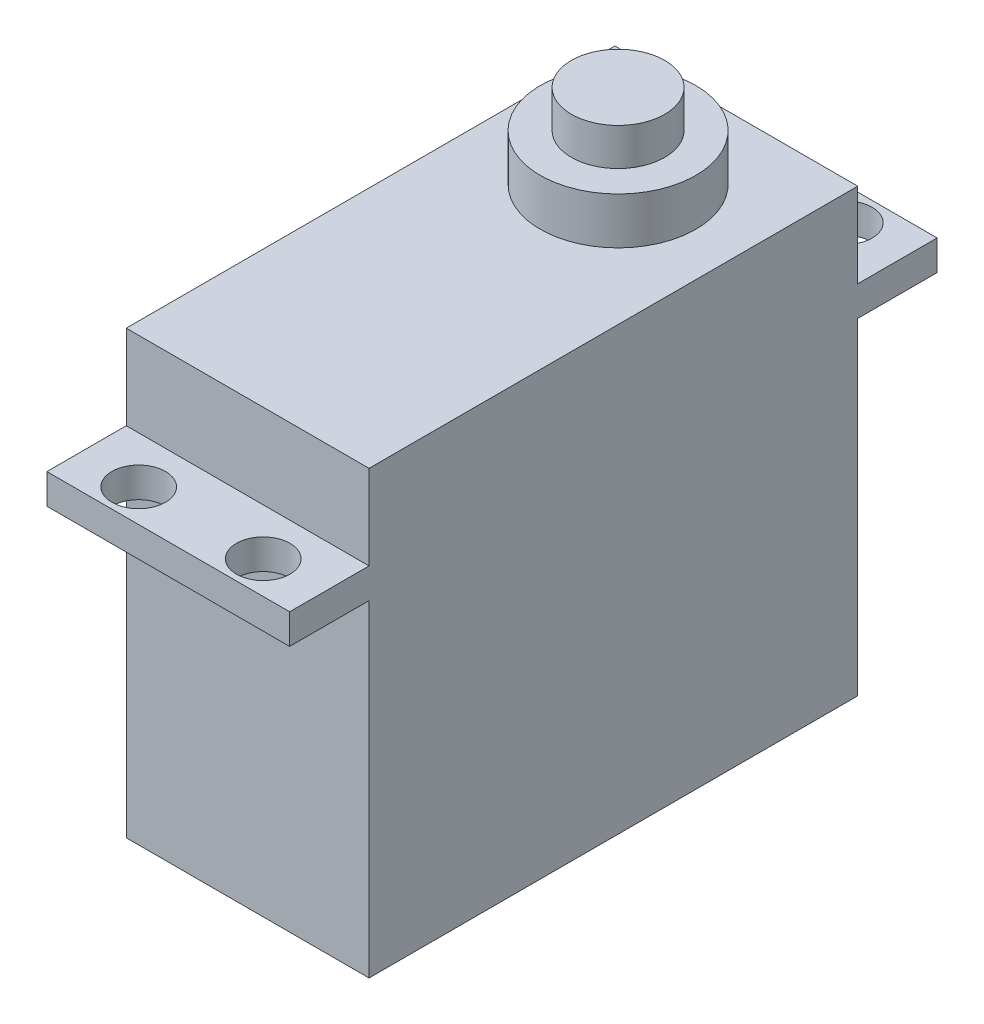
ISO-10303-21;
HEADER;
FILE_DESCRIPTION(('STEP AP214'),'2;1');
FILE_NAME('part.step','',(''),(''),'','','');
FILE_SCHEMA(('AUTOMOTIVE_DESIGN { 1 0 10303 214 1 1 1 1 }'));
ENDSEC;
DATA;
#1=APPLICATION_CONTEXT('core data for automotive mechanical design processes');
#2=APPLICATION_PROTOCOL_DEFINITION('international standard','automotive_design',2000,#1);
#3=PRODUCT_CONTEXT('',#1,'mechanical');
#4=PRODUCT('Part','Part','',(#3));
#5=PRODUCT_RELATED_PRODUCT_CATEGORY('part','',(#4));
#6=PRODUCT_DEFINITION_FORMATION('','',#4);
#7=PRODUCT_DEFINITION_CONTEXT('part definition',#1,'design');
#8=PRODUCT_DEFINITION('design','',#6,#7);
#9=PRODUCT_DEFINITION_SHAPE('','',#8);
#10=(LENGTH_UNIT() NAMED_UNIT(*) SI_UNIT(.MILLI.,.METRE.));
#11=(NAMED_UNIT(*) PLANE_ANGLE_UNIT() SI_UNIT($,.RADIAN.));
#12=(NAMED_UNIT(*) SI_UNIT($,.STERADIAN.) SOLID_ANGLE_UNIT());
#13=UNCERTAINTY_MEASURE_WITH_UNIT(LENGTH_MEASURE(1.E-05),#10,'distance_accuracy_value','');
#14=(GEOMETRIC_REPRESENTATION_CONTEXT(3) GLOBAL_UNCERTAINTY_ASSIGNED_CONTEXT((#13)) GLOBAL_UNIT_ASSIGNED_CONTEXT((#10,
#11,#12)) REPRESENTATION_CONTEXT('',''));
#15=CARTESIAN_POINT('',(0.,0.,0.));
#16=DIRECTION('',(0.,0.,1.));
#17=DIRECTION('',(1.,0.,0.));
#18=AXIS2_PLACEMENT_3D('',#15,#16,#17);
#19=CARTESIAN_POINT('',(0.,39.8272,-10.287));
#20=DIRECTION('',(0.,1.,0.));
#21=DIRECTION('',(0.,0.,1.));
#22=AXIS2_PLACEMENT_3D('',#19,#20,#21);
#23=PLANE('',#22);
#24=CARTESIAN_POINT('',(0.,39.8272,-10.287));
#25=DIRECTION('',(0.,1.,0.));
#26=DIRECTION('',(0.,0.,1.));
#27=AXIS2_PLACEMENT_3D('',#24,#25,#26);
#28=CIRCLE('',#27,6.35);
#29=CARTESIAN_POINT('',(0.,39.8272,-16.637));
#30=VERTEX_POINT('',#29);
#31=EDGE_CURVE('E248',#30,#30,#28,.T.);
#32=ORIENTED_EDGE('',*,*,#31,.T.);
#33=EDGE_LOOP('',(#32));
#34=FACE_BOUND('',#33,.T.);
#35=CARTESIAN_POINT('',(0.,39.8272,-10.287));
#36=DIRECTION('',(0.,1.,0.));
#37=DIRECTION('',(0.,0.,1.));
#38=AXIS2_PLACEMENT_3D('',#35,#36,#37);
#39=CIRCLE('',#38,3.81);
#40=CARTESIAN_POINT('',(0.,39.8272,-14.097));
#41=VERTEX_POINT('',#40);
#42=EDGE_CURVE('E256',#41,#41,#39,.T.);
#43=ORIENTED_EDGE('',*,*,#42,.F.);
#44=EDGE_LOOP('',(#43));
#45=FACE_BOUND('',#44,.T.);
#46=ADVANCED_FACE('F31',(#34,#45),#23,.T.);
#47=CARTESIAN_POINT('',(-9.906,36.0172,19.939));
#48=DIRECTION('',(0.,1.,0.));
#49=DIRECTION('',(0.,0.,1.));
#50=AXIS2_PLACEMENT_3D('',#47,#48,#49);
#51=PLANE('',#50);
#52=DIRECTION('',(0.,0.,1.));
#53=VECTOR('',#52,1.);
#54=CARTESIAN_POINT('',(-9.906,36.0172,-19.939));
#55=LINE('',#54,#53);
#56=CARTESIAN_POINT('',(-9.906,36.0172,-19.939));
#57=VERTEX_POINT('',#56);
#58=CARTESIAN_POINT('',(-9.906,36.0172,19.939));
#59=VERTEX_POINT('',#58);
#60=EDGE_CURVE('E457',#57,#59,#55,.T.);
#61=ORIENTED_EDGE('',*,*,#60,.T.);
#62=DIRECTION('',(1.,0.,0.));
#63=VECTOR('',#62,1.);
#64=CARTESIAN_POINT('',(-9.906,36.0172,19.939));
#65=LINE('',#64,#63);
#66=CARTESIAN_POINT('',(9.906,36.0172,19.939));
#67=VERTEX_POINT('',#66);
#68=EDGE_CURVE('E490',#59,#67,#65,.T.);
#69=ORIENTED_EDGE('',*,*,#68,.T.);
#70=DIRECTION('',(0.,0.,-1.));
#71=VECTOR('',#70,1.);
#72=CARTESIAN_POINT('',(9.906,36.0172,-19.939));
#73=LINE('',#72,#71);
#74=CARTESIAN_POINT('',(9.906,36.0172,-19.939));
#75=VERTEX_POINT('',#74);
#76=EDGE_CURVE('E491',#67,#75,#73,.T.);
#77=ORIENTED_EDGE('',*,*,#76,.T.);
#78=DIRECTION('',(-1.,0.,0.));
#79=VECTOR('',#78,1.);
#80=CARTESIAN_POINT('',(-9.906,36.0172,-19.939));
#81=LINE('',#80,#79);
#82=EDGE_CURVE('E451',#75,#57,#81,.T.);
#83=ORIENTED_EDGE('',*,*,#82,.T.);
#84=EDGE_LOOP('',(#61,#69,#77,#83));
#85=FACE_BOUND('',#84,.T.);
#86=CARTESIAN_POINT('',(0.,36.0172,-10.287));
#87=DIRECTION('',(0.,1.,0.));
#88=DIRECTION('',(0.,0.,1.));
#89=AXIS2_PLACEMENT_3D('',#86,#87,#88);
#90=CIRCLE('',#89,6.35);
#91=CARTESIAN_POINT('',(0.,36.0172,-16.637));
#92=VERTEX_POINT('',#91);
#93=EDGE_CURVE('E251',#92,#92,#90,.T.);
#94=ORIENTED_EDGE('',*,*,#93,.F.);
#95=EDGE_LOOP('',(#94));
#96=FACE_BOUND('',#95,.T.);
#97=ADVANCED_FACE('F211',(#85,#96),#51,.T.);
#98=CARTESIAN_POINT('',(-9.906,26.67,26.416));
#99=DIRECTION('',(0.,1.,0.));
#100=DIRECTION('',(0.,0.,1.));
#101=AXIS2_PLACEMENT_3D('',#98,#99,#100);
#102=PLANE('',#101);
#103=DIRECTION('',(1.,0.,0.));
#104=VECTOR('',#103,1.);
#105=CARTESIAN_POINT('',(-9.906,26.67,19.939));
#106=LINE('',#105,#104);
#107=CARTESIAN_POINT('',(-9.906,26.67,19.939));
#108=VERTEX_POINT('',#107);
#109=CARTESIAN_POINT('',(9.906,26.67,19.939));
#110=VERTEX_POINT('',#109);
#111=EDGE_CURVE('E56',#108,#110,#106,.T.);
#112=ORIENTED_EDGE('',*,*,#111,.T.);
#113=DIRECTION('',(0.,0.,-1.));
#114=VECTOR('',#113,1.);
#115=CARTESIAN_POINT('',(9.906,26.67,26.416));
#116=LINE('',#115,#114);
#117=CARTESIAN_POINT('',(9.906,26.67,26.416));
#118=VERTEX_POINT('',#117);
#119=EDGE_CURVE('E448',#118,#110,#116,.T.);
#120=ORIENTED_EDGE('',*,*,#119,.F.);
#121=DIRECTION('',(1.,0.,0.));
#122=VECTOR('',#121,1.);
#123=CARTESIAN_POINT('',(-9.906,26.67,26.416));
#124=LINE('',#123,#122);
#125=CARTESIAN_POINT('',(-9.906,26.67,26.416));
#126=VERTEX_POINT('',#125);
#127=EDGE_CURVE('E518',#126,#118,#124,.T.);
#128=ORIENTED_EDGE('',*,*,#127,.F.);
#129=DIRECTION('',(0.,0.,-1.));
#130=VECTOR('',#129,1.);
#131=CARTESIAN_POINT('',(-9.906,26.67,26.416));
#132=LINE('',#131,#130);
#133=EDGE_CURVE('E443',#126,#108,#132,.T.);
#134=ORIENTED_EDGE('',*,*,#133,.T.);
#135=EDGE_LOOP('',(#112,#120,#128,#134));
#136=FACE_BOUND('',#135,.T.);
#137=CARTESIAN_POINT('',(5.08,26.67,23.749));
#138=DIRECTION('',(0.,1.,0.));
#139=DIRECTION('',(0.,0.,1.));
#140=AXIS2_PLACEMENT_3D('',#137,#138,#139);
#141=CIRCLE('',#140,2.1844);
#142=CARTESIAN_POINT('',(5.08,26.67,25.9334));
#143=VERTEX_POINT('',#142);
#144=EDGE_CURVE('E157',#143,#143,#141,.T.);
#145=ORIENTED_EDGE('',*,*,#144,.T.);
#146=EDGE_LOOP('',(#145));
#147=FACE_BOUND('',#146,.T.);
#148=CARTESIAN_POINT('',(-5.08,26.67,23.749));
#149=DIRECTION('',(0.,1.,0.));
#150=DIRECTION('',(0.,0.,1.));
#151=AXIS2_PLACEMENT_3D('',#148,#149,#150);
#152=CIRCLE('',#151,2.1844);
#153=CARTESIAN_POINT('',(-5.08,26.67,25.9334));
#154=VERTEX_POINT('',#153);
#155=EDGE_CURVE('E242',#154,#154,#152,.F.);
#156=ORIENTED_EDGE('',*,*,#155,.F.);
#157=EDGE_LOOP('',(#156));
#158=FACE_BOUND('',#157,.T.);
#159=ADVANCED_FACE('F193',(#136,#147,#158),#102,.F.);
#160=CARTESIAN_POINT('',(-9.906,29.12,26.416));
#161=DIRECTION('',(0.,-1.,0.));
#162=DIRECTION('',(0.,0.,-1.));
#163=AXIS2_PLACEMENT_3D('',#160,#161,#162);
#164=PLANE('',#163);
#165=DIRECTION('',(-1.,0.,0.));
#166=VECTOR('',#165,1.);
#167=CARTESIAN_POINT('',(-9.906,29.12,19.939));
#168=LINE('',#167,#166);
#169=CARTESIAN_POINT('',(9.906,29.12,19.939));
#170=VERTEX_POINT('',#169);
#171=CARTESIAN_POINT('',(-9.906,29.12,19.939));
#172=VERTEX_POINT('',#171);
#173=EDGE_CURVE('E477',#170,#172,#168,.T.);
#174=ORIENTED_EDGE('',*,*,#173,.T.);
#175=DIRECTION('',(0.,0.,-1.));
#176=VECTOR('',#175,1.);
#177=CARTESIAN_POINT('',(-9.906,29.12,26.416));
#178=LINE('',#177,#176);
#179=CARTESIAN_POINT('',(-9.906,29.12,26.416));
#180=VERTEX_POINT('',#179);
#181=EDGE_CURVE('E471',#180,#172,#178,.T.);
#182=ORIENTED_EDGE('',*,*,#181,.F.);
#183=DIRECTION('',(-1.,0.,0.));
#184=VECTOR('',#183,1.);
#185=CARTESIAN_POINT('',(-9.906,29.12,26.416));
#186=LINE('',#185,#184);
#187=CARTESIAN_POINT('',(9.906,29.12,26.416));
#188=VERTEX_POINT('',#187);
#189=EDGE_CURVE('E476',#188,#180,#186,.T.);
#190=ORIENTED_EDGE('',*,*,#189,.F.);
#191=DIRECTION('',(0.,0.,-1.));
#192=VECTOR('',#191,1.);
#193=CARTESIAN_POINT('',(9.906,29.12,26.416));
#194=LINE('',#193,#192);
#195=EDGE_CURVE('E468',#188,#170,#194,.T.);
#196=ORIENTED_EDGE('',*,*,#195,.T.);
#197=EDGE_LOOP('',(#174,#182,#190,#196));
#198=FACE_BOUND('',#197,.T.);
#199=CARTESIAN_POINT('',(5.08,29.12,23.749));
#200=DIRECTION('',(0.,1.,0.));
#201=DIRECTION('',(0.,0.,1.));
#202=AXIS2_PLACEMENT_3D('',#199,#200,#201);
#203=CIRCLE('',#202,2.1844);
#204=CARTESIAN_POINT('',(5.08,29.12,25.9334));
#205=VERTEX_POINT('',#204);
#206=EDGE_CURVE('E177',#205,#205,#203,.T.);
#207=ORIENTED_EDGE('',*,*,#206,.F.);
#208=EDGE_LOOP('',(#207));
#209=FACE_BOUND('',#208,.T.);
#210=CARTESIAN_POINT('',(-5.08,29.12,23.749));
#211=DIRECTION('',(0.,-1.,0.));
#212=DIRECTION('',(0.,0.,1.));
#213=AXIS2_PLACEMENT_3D('',#210,#211,#212);
#214=CIRCLE('',#213,2.1844);
#215=CARTESIAN_POINT('',(-5.08,29.12,25.9334));
#216=VERTEX_POINT('',#215);
#217=EDGE_CURVE('E244',#216,#216,#214,.T.);
#218=ORIENTED_EDGE('',*,*,#217,.T.);
#219=EDGE_LOOP('',(#218));
#220=FACE_BOUND('',#219,.T.);
#221=ADVANCED_FACE('F326',(#198,#209,#220),#164,.F.);
#222=CARTESIAN_POINT('',(-9.906,29.12,-26.416));
#223=DIRECTION('',(0.,1.,0.));
#224=DIRECTION('',(0.,0.,1.));
#225=AXIS2_PLACEMENT_3D('',#222,#223,#224);
#226=PLANE('',#225);
#227=CARTESIAN_POINT('',(-5.08,29.12,-23.749));
#228=DIRECTION('',(0.,1.,0.));
#229=DIRECTION('',(0.,0.,-1.));
#230=AXIS2_PLACEMENT_3D('',#227,#228,#229);
#231=CIRCLE('',#230,2.1844);
#232=CARTESIAN_POINT('',(-5.08,29.12,-25.9334));
#233=VERTEX_POINT('',#232);
#234=EDGE_CURVE('E187',#233,#233,#231,.T.);
#235=ORIENTED_EDGE('',*,*,#234,.F.);
#236=EDGE_LOOP('',(#235));
#237=FACE_BOUND('',#236,.T.);
#238=DIRECTION('',(-1.,0.,0.));
#239=VECTOR('',#238,1.);
#240=CARTESIAN_POINT('',(-9.906,29.12,-19.939));
#241=LINE('',#240,#239);
#242=CARTESIAN_POINT('',(9.906,29.12,-19.939));
#243=VERTEX_POINT('',#242);
#244=CARTESIAN_POINT('',(-9.906,29.12,-19.939));
#245=VERTEX_POINT('',#244);
#246=EDGE_CURVE('E155',#243,#245,#241,.T.);
#247=ORIENTED_EDGE('',*,*,#246,.F.);
#248=DIRECTION('',(0.,0.,1.));
#249=VECTOR('',#248,1.);
#250=CARTESIAN_POINT('',(9.906,29.12,-26.416));
#251=LINE('',#250,#249);
#252=CARTESIAN_POINT('',(9.906,29.12,-26.416));
#253=VERTEX_POINT('',#252);
#254=EDGE_CURVE('E129',#253,#243,#251,.T.);
#255=ORIENTED_EDGE('',*,*,#254,.F.);
#256=DIRECTION('',(-1.,0.,0.));
#257=VECTOR('',#256,1.);
#258=CARTESIAN_POINT('',(-9.906,29.12,-26.416));
#259=LINE('',#258,#257);
#260=CARTESIAN_POINT('',(-9.906,29.12,-26.416));
#261=VERTEX_POINT('',#260);
#262=EDGE_CURVE('E135',#253,#261,#259,.T.);
#263=ORIENTED_EDGE('',*,*,#262,.T.);
#264=DIRECTION('',(0.,0.,1.));
#265=VECTOR('',#264,1.);
#266=CARTESIAN_POINT('',(-9.906,29.12,-26.416));
#267=LINE('',#266,#265);
#268=EDGE_CURVE('E48',#261,#245,#267,.T.);
#269=ORIENTED_EDGE('',*,*,#268,.T.);
#270=EDGE_LOOP('',(#247,#255,#263,#269));
#271=FACE_BOUND('',#270,.T.);
#272=CARTESIAN_POINT('',(5.08,29.12,-23.749));
#273=DIRECTION('',(0.,-1.,0.));
#274=DIRECTION('',(0.,0.,-1.));
#275=AXIS2_PLACEMENT_3D('',#272,#273,#274);
#276=CIRCLE('',#275,2.1844);
#277=CARTESIAN_POINT('',(5.08,29.12,-25.9334));
#278=VERTEX_POINT('',#277);
#279=EDGE_CURVE('E178',#278,#278,#276,.T.);
#280=ORIENTED_EDGE('',*,*,#279,.T.);
#281=EDGE_LOOP('',(#280));
#282=FACE_BOUND('',#281,.T.);
#283=ADVANCED_FACE('F141',(#237,#271,#282),#226,.T.);
#284=CARTESIAN_POINT('',(-9.906,26.67,-26.416));
#285=DIRECTION('',(0.,-1.,0.));
#286=DIRECTION('',(0.,0.,-1.));
#287=AXIS2_PLACEMENT_3D('',#284,#285,#286);
#288=PLANE('',#287);
#289=CARTESIAN_POINT('',(-5.08,26.67,-23.749));
#290=DIRECTION('',(0.,-1.,0.));
#291=DIRECTION('',(0.,0.,-1.));
#292=AXIS2_PLACEMENT_3D('',#289,#290,#291);
#293=CIRCLE('',#292,2.1844);
#294=CARTESIAN_POINT('',(-5.08,26.67,-25.9334));
#295=VERTEX_POINT('',#294);
#296=EDGE_CURVE('E35',#295,#295,#293,.T.);
#297=ORIENTED_EDGE('',*,*,#296,.F.);
#298=EDGE_LOOP('',(#297));
#299=FACE_BOUND('',#298,.T.);
#300=DIRECTION('',(1.,0.,0.));
#301=VECTOR('',#300,1.);
#302=CARTESIAN_POINT('',(-9.906,26.67,-19.939));
#303=LINE('',#302,#301);
#304=CARTESIAN_POINT('',(-9.906,26.67,-19.939));
#305=VERTEX_POINT('',#304);
#306=CARTESIAN_POINT('',(9.906,26.67,-19.939));
#307=VERTEX_POINT('',#306);
#308=EDGE_CURVE('E139',#305,#307,#303,.T.);
#309=ORIENTED_EDGE('',*,*,#308,.F.);
#310=DIRECTION('',(0.,0.,1.));
#311=VECTOR('',#310,1.);
#312=CARTESIAN_POINT('',(-9.906,26.67,-26.416));
#313=LINE('',#312,#311);
#314=CARTESIAN_POINT('',(-9.906,26.67,-26.416));
#315=VERTEX_POINT('',#314);
#316=EDGE_CURVE('E149',#315,#305,#313,.T.);
#317=ORIENTED_EDGE('',*,*,#316,.F.);
#318=DIRECTION('',(1.,0.,0.));
#319=VECTOR('',#318,1.);
#320=CARTESIAN_POINT('',(-9.906,26.67,-26.416));
#321=LINE('',#320,#319);
#322=CARTESIAN_POINT('',(9.906,26.67,-26.416));
#323=VERTEX_POINT('',#322);
#324=EDGE_CURVE('E138',#315,#323,#321,.T.);
#325=ORIENTED_EDGE('',*,*,#324,.T.);
#326=DIRECTION('',(0.,0.,1.));
#327=VECTOR('',#326,1.);
#328=CARTESIAN_POINT('',(9.906,26.67,-26.416));
#329=LINE('',#328,#327);
#330=EDGE_CURVE('E165',#323,#307,#329,.T.);
#331=ORIENTED_EDGE('',*,*,#330,.T.);
#332=EDGE_LOOP('',(#309,#317,#325,#331));
#333=FACE_BOUND('',#332,.T.);
#334=CARTESIAN_POINT('',(5.08,26.67,-23.749));
#335=DIRECTION('',(0.,-1.,0.));
#336=DIRECTION('',(0.,0.,-1.));
#337=AXIS2_PLACEMENT_3D('',#334,#335,#336);
#338=CIRCLE('',#337,2.1844);
#339=CARTESIAN_POINT('',(5.08,26.67,-25.9334));
#340=VERTEX_POINT('',#339);
#341=EDGE_CURVE('E175',#340,#340,#338,.F.);
#342=ORIENTED_EDGE('',*,*,#341,.T.);
#343=EDGE_LOOP('',(#342));
#344=FACE_BOUND('',#343,.T.);
#345=ADVANCED_FACE('F309',(#299,#333,#344),#288,.T.);
#346=CARTESIAN_POINT('',(-9.906,36.0172,-19.939));
#347=DIRECTION('',(0.,0.,1.));
#348=DIRECTION('',(1.,0.,0.));
#349=AXIS2_PLACEMENT_3D('',#346,#347,#348);
#350=PLANE('',#349);
#351=DIRECTION('',(0.,-1.,0.));
#352=VECTOR('',#351,1.);
#353=CARTESIAN_POINT('',(-9.906,36.0172,-19.939));
#354=LINE('',#353,#352);
#355=CARTESIAN_POINT('',(-9.906,0.,-19.939));
#356=VERTEX_POINT('',#355);
#357=EDGE_CURVE('E463',#305,#356,#354,.T.);
#358=ORIENTED_EDGE('',*,*,#357,.F.);
#359=ORIENTED_EDGE('',*,*,#308,.T.);
#360=DIRECTION('',(0.,-1.,0.));
#361=VECTOR('',#360,1.);
#362=CARTESIAN_POINT('',(9.906,36.0172,-19.939));
#363=LINE('',#362,#361);
#364=CARTESIAN_POINT('',(9.906,0.,-19.939));
#365=VERTEX_POINT('',#364);
#366=EDGE_CURVE('E158',#307,#365,#363,.T.);
#367=ORIENTED_EDGE('',*,*,#366,.T.);
#368=DIRECTION('',(-1.,0.,0.));
#369=VECTOR('',#368,1.);
#370=CARTESIAN_POINT('',(-9.906,0.,-19.939));
#371=LINE('',#370,#369);
#372=EDGE_CURVE('E440',#365,#356,#371,.T.);
#373=ORIENTED_EDGE('',*,*,#372,.T.);
#374=EDGE_LOOP('',(#358,#359,#367,#373));
#375=FACE_BOUND('',#374,.T.);
#376=ADVANCED_FACE('F314',(#375),#350,.F.);
#377=CARTESIAN_POINT('',(-9.906,36.0172,19.939));
#378=DIRECTION('',(0.,0.,-1.));
#379=DIRECTION('',(-1.,0.,0.));
#380=AXIS2_PLACEMENT_3D('',#377,#378,#379);
#381=PLANE('',#380);
#382=ORIENTED_EDGE('',*,*,#173,.F.);
#383=DIRECTION('',(0.,-1.,0.));
#384=VECTOR('',#383,1.);
#385=CARTESIAN_POINT('',(9.906,36.0172,19.939));
#386=LINE('',#385,#384);
#387=EDGE_CURVE('E503',#67,#170,#386,.T.);
#388=ORIENTED_EDGE('',*,*,#387,.F.);
#389=ORIENTED_EDGE('',*,*,#68,.F.);
#390=DIRECTION('',(0.,-1.,0.));
#391=VECTOR('',#390,1.);
#392=CARTESIAN_POINT('',(-9.906,36.0172,19.939));
#393=LINE('',#392,#391);
#394=EDGE_CURVE('E11',#59,#172,#393,.T.);
#395=ORIENTED_EDGE('',*,*,#394,.T.);
#396=EDGE_LOOP('',(#382,#388,#389,#395));
#397=FACE_BOUND('',#396,.T.);
#398=ADVANCED_FACE('F401',(#397),#381,.F.);
#399=ORIENTED_EDGE('',*,*,#111,.F.);
#400=CARTESIAN_POINT('',(-9.906,0.,19.939));
#401=VERTEX_POINT('',#400);
#402=EDGE_CURVE('E40',#108,#401,#393,.T.);
#403=ORIENTED_EDGE('',*,*,#402,.T.);
#404=DIRECTION('',(1.,0.,0.));
#405=VECTOR('',#404,1.);
#406=CARTESIAN_POINT('',(-9.906,0.,19.939));
#407=LINE('',#406,#405);
#408=CARTESIAN_POINT('',(9.906,0.,19.939));
#409=VERTEX_POINT('',#408);
#410=EDGE_CURVE('E442',#401,#409,#407,.T.);
#411=ORIENTED_EDGE('',*,*,#410,.T.);
#412=EDGE_CURVE('E500',#110,#409,#386,.T.);
#413=ORIENTED_EDGE('',*,*,#412,.F.);
#414=EDGE_LOOP('',(#399,#403,#411,#413));
#415=FACE_BOUND('',#414,.T.);
#416=ADVANCED_FACE('F392',(#415),#381,.F.);
#417=CARTESIAN_POINT('',(-9.906,36.0172,-19.939));
#418=DIRECTION('',(1.,0.,0.));
#419=DIRECTION('',(0.,0.,-1.));
#420=AXIS2_PLACEMENT_3D('',#417,#418,#419);
#421=PLANE('',#420);
#422=DIRECTION('',(0.,0.,1.));
#423=VECTOR('',#422,1.);
#424=CARTESIAN_POINT('',(-9.906,0.,-19.939));
#425=LINE('',#424,#423);
#426=EDGE_CURVE('E437',#356,#401,#425,.T.);
#427=ORIENTED_EDGE('',*,*,#426,.T.);
#428=ORIENTED_EDGE('',*,*,#402,.F.);
#429=ORIENTED_EDGE('',*,*,#133,.F.);
#430=DIRECTION('',(0.,-1.,0.));
#431=VECTOR('',#430,1.);
#432=CARTESIAN_POINT('',(-9.906,29.12,26.416));
#433=LINE('',#432,#431);
#434=EDGE_CURVE('E481',#180,#126,#433,.T.);
#435=ORIENTED_EDGE('',*,*,#434,.F.);
#436=ORIENTED_EDGE('',*,*,#181,.T.);
#437=ORIENTED_EDGE('',*,*,#394,.F.);
#438=ORIENTED_EDGE('',*,*,#60,.F.);
#439=EDGE_CURVE('E128',#57,#245,#354,.T.);
#440=ORIENTED_EDGE('',*,*,#439,.T.);
#441=ORIENTED_EDGE('',*,*,#268,.F.);
#442=DIRECTION('',(0.,-1.,0.));
#443=VECTOR('',#442,1.);
#444=CARTESIAN_POINT('',(-9.906,29.12,-26.416));
#445=LINE('',#444,#443);
#446=EDGE_CURVE('E124',#261,#315,#445,.T.);
#447=ORIENTED_EDGE('',*,*,#446,.T.);
#448=ORIENTED_EDGE('',*,*,#316,.T.);
#449=ORIENTED_EDGE('',*,*,#357,.T.);
#450=EDGE_LOOP('',(#427,#428,#429,#435,#436,#437,#438,#440,#441,#447,#448,#449));
#451=FACE_BOUND('',#450,.T.);
#452=ADVANCED_FACE('F33',(#451),#421,.F.);
#453=CARTESIAN_POINT('',(9.906,36.0172,-19.939));
#454=DIRECTION('',(-1.,0.,0.));
#455=DIRECTION('',(0.,0.,1.));
#456=AXIS2_PLACEMENT_3D('',#453,#454,#455);
#457=PLANE('',#456);
#458=DIRECTION('',(0.,0.,-1.));
#459=VECTOR('',#458,1.);
#460=CARTESIAN_POINT('',(9.906,0.,-19.939));
#461=LINE('',#460,#459);
#462=EDGE_CURVE('E445',#409,#365,#461,.T.);
#463=ORIENTED_EDGE('',*,*,#462,.T.);
#464=ORIENTED_EDGE('',*,*,#366,.F.);
#465=ORIENTED_EDGE('',*,*,#330,.F.);
#466=DIRECTION('',(0.,1.,0.));
#467=VECTOR('',#466,1.);
#468=CARTESIAN_POINT('',(9.906,29.12,-26.416));
#469=LINE('',#468,#467);
#470=EDGE_CURVE('E143',#323,#253,#469,.T.);
#471=ORIENTED_EDGE('',*,*,#470,.T.);
#472=ORIENTED_EDGE('',*,*,#254,.T.);
#473=EDGE_CURVE('E498',#75,#243,#363,.T.);
#474=ORIENTED_EDGE('',*,*,#473,.F.);
#475=ORIENTED_EDGE('',*,*,#76,.F.);
#476=ORIENTED_EDGE('',*,*,#387,.T.);
#477=ORIENTED_EDGE('',*,*,#195,.F.);
#478=DIRECTION('',(0.,1.,0.));
#479=VECTOR('',#478,1.);
#480=CARTESIAN_POINT('',(9.906,29.12,26.416));
#481=LINE('',#480,#479);
#482=EDGE_CURVE('E523',#118,#188,#481,.T.);
#483=ORIENTED_EDGE('',*,*,#482,.F.);
#484=ORIENTED_EDGE('',*,*,#119,.T.);
#485=ORIENTED_EDGE('',*,*,#412,.T.);
#486=EDGE_LOOP('',(#463,#464,#465,#471,#472,#474,#475,#476,#477,#483,#484,#485));
#487=FACE_BOUND('',#486,.T.);
#488=ADVANCED_FACE('F370',(#487),#457,.F.);
#489=ORIENTED_EDGE('',*,*,#473,.T.);
#490=ORIENTED_EDGE('',*,*,#246,.T.);
#491=ORIENTED_EDGE('',*,*,#439,.F.);
#492=ORIENTED_EDGE('',*,*,#82,.F.);
#493=EDGE_LOOP('',(#489,#490,#491,#492));
#494=FACE_BOUND('',#493,.T.);
#495=ADVANCED_FACE('F364',(#494),#350,.F.);
#496=CARTESIAN_POINT('',(-9.906,0.,19.939));
#497=DIRECTION('',(0.,1.,0.));
#498=DIRECTION('',(0.,0.,1.));
#499=AXIS2_PLACEMENT_3D('',#496,#497,#498);
#500=PLANE('',#499);
#501=ORIENTED_EDGE('',*,*,#426,.F.);
#502=ORIENTED_EDGE('',*,*,#372,.F.);
#503=ORIENTED_EDGE('',*,*,#462,.F.);
#504=ORIENTED_EDGE('',*,*,#410,.F.);
#505=EDGE_LOOP('',(#501,#502,#503,#504));
#506=FACE_BOUND('',#505,.T.);
#507=ADVANCED_FACE('F369',(#506),#500,.F.);
#508=CARTESIAN_POINT('',(-9.906,26.67,26.416));
#509=DIRECTION('',(0.,0.,1.));
#510=DIRECTION('',(1.,0.,0.));
#511=AXIS2_PLACEMENT_3D('',#508,#509,#510);
#512=PLANE('',#511);
#513=ORIENTED_EDGE('',*,*,#434,.T.);
#514=ORIENTED_EDGE('',*,*,#127,.T.);
#515=ORIENTED_EDGE('',*,*,#482,.T.);
#516=ORIENTED_EDGE('',*,*,#189,.T.);
#517=EDGE_LOOP('',(#513,#514,#515,#516));
#518=FACE_BOUND('',#517,.T.);
#519=ADVANCED_FACE('F208',(#518),#512,.T.);
#520=CARTESIAN_POINT('',(-9.906,26.67,-26.416));
#521=DIRECTION('',(0.,0.,-1.));
#522=DIRECTION('',(1.,0.,0.));
#523=AXIS2_PLACEMENT_3D('',#520,#521,#522);
#524=PLANE('',#523);
#525=ORIENTED_EDGE('',*,*,#446,.F.);
#526=ORIENTED_EDGE('',*,*,#262,.F.);
#527=ORIENTED_EDGE('',*,*,#470,.F.);
#528=ORIENTED_EDGE('',*,*,#324,.F.);
#529=EDGE_LOOP('',(#525,#526,#527,#528));
#530=FACE_BOUND('',#529,.T.);
#531=ADVANCED_FACE('F133',(#530),#524,.T.);
#532=CARTESIAN_POINT('',(5.08,-2.50000000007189E-05,23.749));
#533=DIRECTION('',(0.,1.,0.));
#534=DIRECTION('',(0.,0.,1.));
#535=AXIS2_PLACEMENT_3D('',#532,#533,#534);
#536=CYLINDRICAL_SURFACE('',#535,2.1844);
#537=ORIENTED_EDGE('',*,*,#206,.T.);
#538=EDGE_LOOP('',(#537));
#539=FACE_BOUND('',#538,.T.);
#540=ORIENTED_EDGE('',*,*,#144,.F.);
#541=EDGE_LOOP('',(#540));
#542=FACE_BOUND('',#541,.T.);
#543=ADVANCED_FACE('F196',(#539,#542),#536,.F.);
#544=CARTESIAN_POINT('',(5.08,-2.50000000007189E-05,-23.749));
#545=DIRECTION('',(0.,1.,0.));
#546=DIRECTION('',(0.,0.,1.));
#547=AXIS2_PLACEMENT_3D('',#544,#545,#546);
#548=CYLINDRICAL_SURFACE('',#547,2.1844);
#549=ORIENTED_EDGE('',*,*,#341,.F.);
#550=EDGE_LOOP('',(#549));
#551=FACE_BOUND('',#550,.T.);
#552=ORIENTED_EDGE('',*,*,#279,.F.);
#553=EDGE_LOOP('',(#552));
#554=FACE_BOUND('',#553,.T.);
#555=ADVANCED_FACE('F198',(#551,#554),#548,.F.);
#556=CARTESIAN_POINT('',(-5.08,-2.50000000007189E-05,-23.749));
#557=DIRECTION('',(0.,1.,0.));
#558=DIRECTION('',(0.,0.,1.));
#559=AXIS2_PLACEMENT_3D('',#556,#557,#558);
#560=CYLINDRICAL_SURFACE('',#559,2.1844);
#561=ORIENTED_EDGE('',*,*,#296,.T.);
#562=EDGE_LOOP('',(#561));
#563=FACE_BOUND('',#562,.T.);
#564=ORIENTED_EDGE('',*,*,#234,.T.);
#565=EDGE_LOOP('',(#564));
#566=FACE_BOUND('',#565,.T.);
#567=ADVANCED_FACE('F205',(#563,#566),#560,.F.);
#568=CARTESIAN_POINT('',(-5.08,-2.50000000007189E-05,23.749));
#569=DIRECTION('',(0.,1.,0.));
#570=DIRECTION('',(0.,0.,1.));
#571=AXIS2_PLACEMENT_3D('',#568,#569,#570);
#572=CYLINDRICAL_SURFACE('',#571,2.1844);
#573=ORIENTED_EDGE('',*,*,#217,.F.);
#574=EDGE_LOOP('',(#573));
#575=FACE_BOUND('',#574,.T.);
#576=ORIENTED_EDGE('',*,*,#155,.T.);
#577=EDGE_LOOP('',(#576));
#578=FACE_BOUND('',#577,.T.);
#579=ADVANCED_FACE('F228',(#575,#578),#572,.F.);
#580=CARTESIAN_POINT('',(0.,39.8272,-10.287));
#581=DIRECTION('',(0.,-1.,0.));
#582=DIRECTION('',(0.,0.,-1.));
#583=AXIS2_PLACEMENT_3D('',#580,#581,#582);
#584=CYLINDRICAL_SURFACE('',#583,6.35);
#585=CARTESIAN_POINT('',(0.,39.8272,-16.637));
#586=CARTESIAN_POINT('',(0.,39.7875125,-16.637));
#587=CARTESIAN_POINT('',(0.,39.747825,-16.637));
#588=CARTESIAN_POINT('',(0.,39.66845,-16.637));
#589=CARTESIAN_POINT('',(0.,39.6287625,-16.637));
#590=CARTESIAN_POINT('',(0.,39.5493875,-16.637));
#591=CARTESIAN_POINT('',(0.,39.5097,-16.637));
#592=CARTESIAN_POINT('',(0.,39.430325,-16.637));
#593=CARTESIAN_POINT('',(0.,39.3906375,-16.637));
#594=CARTESIAN_POINT('',(0.,39.3112625,-16.637));
#595=CARTESIAN_POINT('',(0.,39.271575,-16.637));
#596=CARTESIAN_POINT('',(0.,39.1922,-16.637));
#597=CARTESIAN_POINT('',(0.,39.1525125,-16.637));
#598=CARTESIAN_POINT('',(0.,39.0731375,-16.637));
#599=CARTESIAN_POINT('',(0.,39.03345,-16.637));
#600=CARTESIAN_POINT('',(0.,38.954075,-16.637));
#601=CARTESIAN_POINT('',(0.,38.9143875,-16.637));
#602=CARTESIAN_POINT('',(0.,38.8350125,-16.637));
#603=CARTESIAN_POINT('',(0.,38.795325,-16.637));
#604=CARTESIAN_POINT('',(0.,38.71595,-16.637));
#605=CARTESIAN_POINT('',(0.,38.6762625,-16.637));
#606=CARTESIAN_POINT('',(0.,38.5968875,-16.637));
#607=CARTESIAN_POINT('',(0.,38.5572,-16.637));
#608=CARTESIAN_POINT('',(0.,38.477825,-16.637));
#609=CARTESIAN_POINT('',(0.,38.4381375,-16.637));
#610=CARTESIAN_POINT('',(0.,38.3587625,-16.637));
#611=CARTESIAN_POINT('',(0.,38.319075,-16.637));
#612=CARTESIAN_POINT('',(0.,38.2397,-16.637));
#613=CARTESIAN_POINT('',(0.,38.2000125,-16.637));
#614=CARTESIAN_POINT('',(0.,38.1206375,-16.637));
#615=CARTESIAN_POINT('',(0.,38.08095,-16.637));
#616=CARTESIAN_POINT('',(0.,38.001575,-16.637));
#617=CARTESIAN_POINT('',(0.,37.9618875,-16.637));
#618=CARTESIAN_POINT('',(0.,37.8825125,-16.637));
#619=CARTESIAN_POINT('',(0.,37.842825,-16.637));
#620=CARTESIAN_POINT('',(0.,37.76345,-16.637));
#621=CARTESIAN_POINT('',(0.,37.7237625,-16.637));
#622=CARTESIAN_POINT('',(0.,37.6443875,-16.637));
#623=CARTESIAN_POINT('',(0.,37.6047,-16.637));
#624=CARTESIAN_POINT('',(0.,37.525325,-16.637));
#625=CARTESIAN_POINT('',(0.,37.4856375,-16.637));
#626=CARTESIAN_POINT('',(0.,37.4062625,-16.637));
#627=CARTESIAN_POINT('',(0.,37.366575,-16.637));
#628=CARTESIAN_POINT('',(0.,37.2872,-16.637));
#629=CARTESIAN_POINT('',(0.,37.2475125,-16.637));
#630=CARTESIAN_POINT('',(0.,37.1681375,-16.637));
#631=CARTESIAN_POINT('',(0.,37.12845,-16.637));
#632=CARTESIAN_POINT('',(0.,37.049075,-16.637));
#633=CARTESIAN_POINT('',(0.,37.0093875,-16.637));
#634=CARTESIAN_POINT('',(0.,36.9300125,-16.637));
#635=CARTESIAN_POINT('',(0.,36.890325,-16.637));
#636=CARTESIAN_POINT('',(0.,36.81095,-16.637));
#637=CARTESIAN_POINT('',(0.,36.7712625,-16.637));
#638=CARTESIAN_POINT('',(0.,36.6918875,-16.637));
#639=CARTESIAN_POINT('',(0.,36.6522,-16.637));
#640=CARTESIAN_POINT('',(0.,36.572825,-16.637));
#641=CARTESIAN_POINT('',(0.,36.5331375,-16.637));
#642=CARTESIAN_POINT('',(0.,36.4537625,-16.637));
#643=CARTESIAN_POINT('',(0.,36.414075,-16.637));
#644=CARTESIAN_POINT('',(0.,36.3347,-16.637));
#645=CARTESIAN_POINT('',(0.,36.2950125,-16.637));
#646=CARTESIAN_POINT('',(0.,36.2156375,-16.637));
#647=CARTESIAN_POINT('',(0.,36.17595,-16.637));
#648=CARTESIAN_POINT('',(0.,36.096575,-16.637));
#649=CARTESIAN_POINT('',(0.,36.0568875,-16.637));
#650=CARTESIAN_POINT('',(0.,36.0172,-16.637));
#651=B_SPLINE_CURVE_WITH_KNOTS('',3,(#585,#586,#587,#588,#589,#590,#591,#592,#593,#594,#595,
#596,#597,#598,#599,#600,#601,#602,#603,#604,#605,#606,#607,#608,#609,#610,#611,#612,#613,#614,
#615,#616,#617,#618,#619,#620,#621,#622,#623,#624,#625,#626,#627,#628,#629,#630,#631,#632,#633,
#634,#635,#636,#637,#638,#639,#640,#641,#642,#643,#644,#645,#646,#647,#648,#649,#650),
.UNSPECIFIED.,.F.,.F.,(4,2,2,2,2,2,2,2,2,2,2,2,2,2,2,2,2,2,2,2,2,2,2,2,2,2,2,2,2,2,2,2,4),(0.,
0.119062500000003,0.238125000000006,0.357187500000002,0.476250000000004,0.5953125,
0.714375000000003,0.833437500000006,0.952500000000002,1.0715625,1.190625,1.3096875,
1.42875000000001,1.5478125,1.66687500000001,1.7859375,1.905,2.02406250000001,2.143125,
2.26218750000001,2.38125,2.5003125,2.61937500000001,2.7384375,2.85750000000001,2.9765625,
3.095625,3.2146875,3.33375,3.45281250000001,3.571875,3.6909375,3.81),.UNSPECIFIED.);
#652=EDGE_CURVE('BSEAM225',#30,#92,#651,.T.);
#653=ORIENTED_EDGE('',*,*,#31,.F.);
#654=ORIENTED_EDGE('',*,*,#93,.T.);
#655=ORIENTED_EDGE('',*,*,#652,.T.);
#656=ORIENTED_EDGE('',*,*,#652,.F.);
#657=EDGE_LOOP('',(#653,#655,#654,#656));
#658=FACE_BOUND('',#657,.T.);
#659=ADVANCED_FACE('F225',(#658),#584,.T.);
#660=CARTESIAN_POINT('',(0.,42.8752,-10.287));
#661=DIRECTION('',(0.,-1.,0.));
#662=DIRECTION('',(0.,0.,-1.));
#663=AXIS2_PLACEMENT_3D('',#660,#661,#662);
#664=CYLINDRICAL_SURFACE('',#663,3.81);
#665=CARTESIAN_POINT('',(0.,42.8752,-10.287));
#666=DIRECTION('',(0.,1.,0.));
#667=DIRECTION('',(0.,0.,1.));
#668=AXIS2_PLACEMENT_3D('',#665,#666,#667);
#669=CIRCLE('',#668,3.81);
#670=CARTESIAN_POINT('',(0.,42.8752,-14.097));
#671=VERTEX_POINT('',#670);
#672=EDGE_CURVE('E254',#671,#671,#669,.T.);
#673=CARTESIAN_POINT('',(0.,42.8752,-14.097));
#674=CARTESIAN_POINT('',(0.,42.84345,-14.097));
#675=CARTESIAN_POINT('',(0.,42.8117,-14.097));
#676=CARTESIAN_POINT('',(0.,42.7482,-14.097));
#677=CARTESIAN_POINT('',(0.,42.71645,-14.097));
#678=CARTESIAN_POINT('',(0.,42.65295,-14.097));
#679=CARTESIAN_POINT('',(0.,42.6212,-14.097));
#680=CARTESIAN_POINT('',(0.,42.5577,-14.097));
#681=CARTESIAN_POINT('',(0.,42.52595,-14.097));
#682=CARTESIAN_POINT('',(0.,42.46245,-14.097));
#683=CARTESIAN_POINT('',(0.,42.4307,-14.097));
#684=CARTESIAN_POINT('',(0.,42.3672,-14.097));
#685=CARTESIAN_POINT('',(0.,42.33545,-14.097));
#686=CARTESIAN_POINT('',(0.,42.27195,-14.097));
#687=CARTESIAN_POINT('',(0.,42.2402,-14.097));
#688=CARTESIAN_POINT('',(0.,42.1767,-14.097));
#689=CARTESIAN_POINT('',(0.,42.14495,-14.097));
#690=CARTESIAN_POINT('',(0.,42.08145,-14.097));
#691=CARTESIAN_POINT('',(0.,42.0497,-14.097));
#692=CARTESIAN_POINT('',(0.,41.9862,-14.097));
#693=CARTESIAN_POINT('',(0.,41.95445,-14.097));
#694=CARTESIAN_POINT('',(0.,41.89095,-14.097));
#695=CARTESIAN_POINT('',(0.,41.8592,-14.097));
#696=CARTESIAN_POINT('',(0.,41.7957,-14.097));
#697=CARTESIAN_POINT('',(0.,41.76395,-14.097));
#698=CARTESIAN_POINT('',(0.,41.70045,-14.097));
#699=CARTESIAN_POINT('',(0.,41.6687,-14.097));
#700=CARTESIAN_POINT('',(0.,41.6052,-14.097));
#701=CARTESIAN_POINT('',(0.,41.57345,-14.097));
#702=CARTESIAN_POINT('',(0.,41.50995,-14.097));
#703=CARTESIAN_POINT('',(0.,41.4782,-14.097));
#704=CARTESIAN_POINT('',(0.,41.4147,-14.097));
#705=CARTESIAN_POINT('',(0.,41.38295,-14.097));
#706=CARTESIAN_POINT('',(0.,41.31945,-14.097));
#707=CARTESIAN_POINT('',(0.,41.2877,-14.097));
#708=CARTESIAN_POINT('',(0.,41.2242,-14.097));
#709=CARTESIAN_POINT('',(0.,41.19245,-14.097));
#710=CARTESIAN_POINT('',(0.,41.12895,-14.097));
#711=CARTESIAN_POINT('',(0.,41.0972,-14.097));
#712=CARTESIAN_POINT('',(0.,41.0337,-14.097));
#713=CARTESIAN_POINT('',(0.,41.00195,-14.097));
#714=CARTESIAN_POINT('',(0.,40.93845,-14.097));
#715=CARTESIAN_POINT('',(0.,40.9067,-14.097));
#716=CARTESIAN_POINT('',(0.,40.8432,-14.097));
#717=CARTESIAN_POINT('',(0.,40.81145,-14.097));
#718=CARTESIAN_POINT('',(0.,40.74795,-14.097));
#719=CARTESIAN_POINT('',(0.,40.7162,-14.097));
#720=CARTESIAN_POINT('',(0.,40.6527,-14.097));
#721=CARTESIAN_POINT('',(0.,40.62095,-14.097));
#722=CARTESIAN_POINT('',(0.,40.55745,-14.097));
#723=CARTESIAN_POINT('',(0.,40.5257,-14.097));
#724=CARTESIAN_POINT('',(0.,40.4622,-14.097));
#725=CARTESIAN_POINT('',(0.,40.43045,-14.097));
#726=CARTESIAN_POINT('',(0.,40.36695,-14.097));
#727=CARTESIAN_POINT('',(0.,40.3352,-14.097));
#728=CARTESIAN_POINT('',(0.,40.2717,-14.097));
#729=CARTESIAN_POINT('',(0.,40.23995,-14.097));
#730=CARTESIAN_POINT('',(0.,40.17645,-14.097));
#731=CARTESIAN_POINT('',(0.,40.1447,-14.097));
#732=CARTESIAN_POINT('',(0.,40.0812,-14.097));
#733=CARTESIAN_POINT('',(0.,40.04945,-14.097));
#734=CARTESIAN_POINT('',(0.,39.98595,-14.097));
#735=CARTESIAN_POINT('',(0.,39.9542,-14.097));
#736=CARTESIAN_POINT('',(0.,39.8907,-14.097));
#737=CARTESIAN_POINT('',(0.,39.85895,-14.097));
#738=CARTESIAN_POINT('',(0.,39.8272,-14.097));
#739=B_SPLINE_CURVE_WITH_KNOTS('',3,(#673,#674,#675,#676,#677,#678,#679,#680,#681,#682,#683,
#684,#685,#686,#687,#688,#689,#690,#691,#692,#693,#694,#695,#696,#697,#698,#699,#700,#701,#702,
#703,#704,#705,#706,#707,#708,#709,#710,#711,#712,#713,#714,#715,#716,#717,#718,#719,#720,#721,
#722,#723,#724,#725,#726,#727,#728,#729,#730,#731,#732,#733,#734,#735,#736,#737,#738),
.UNSPECIFIED.,.F.,.F.,(4,2,2,2,2,2,2,2,2,2,2,2,2,2,2,2,2,2,2,2,2,2,2,2,2,2,2,2,2,2,2,2,4),(0.,
0.0952499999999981,0.190499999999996,0.285749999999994,0.380999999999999,0.476249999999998,
0.571499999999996,0.666749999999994,0.761999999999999,0.857249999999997,0.952499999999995,
1.04775,1.143,1.23825,1.33349999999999,1.42875,1.524,1.61925,1.7145,1.80975,1.905,
2.00024999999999,2.0955,2.19075,2.286,2.38125,2.4765,2.57175,2.667,2.76225,2.8575,2.95275,
3.048),.UNSPECIFIED.);
#740=EDGE_CURVE('BSEAM223',#671,#41,#739,.T.);
#741=ORIENTED_EDGE('',*,*,#672,.F.);
#742=ORIENTED_EDGE('',*,*,#42,.T.);
#743=ORIENTED_EDGE('',*,*,#740,.T.);
#744=ORIENTED_EDGE('',*,*,#740,.F.);
#745=EDGE_LOOP('',(#741,#743,#742,#744));
#746=FACE_BOUND('',#745,.T.);
#747=ADVANCED_FACE('F223',(#746),#664,.T.);
#748=CARTESIAN_POINT('',(0.,42.8752,-10.287));
#749=DIRECTION('',(0.,1.,0.));
#750=DIRECTION('',(0.,0.,1.));
#751=AXIS2_PLACEMENT_3D('',#748,#749,#750);
#752=PLANE('',#751);
#753=ORIENTED_EDGE('',*,*,#672,.T.);
#754=EDGE_LOOP('',(#753));
#755=FACE_BOUND('',#754,.T.);
#756=ADVANCED_FACE('F262',(#755),#752,.T.);
#757=CLOSED_SHELL('',(#46,#97,#159,#221,#283,#345,#376,#398,#416,#452,#488,#495,#507,#519,#531,
#543,#555,#567,#579,#659,#747,#756));
#758=MANIFOLD_SOLID_BREP('B2',#757);
#759=ADVANCED_BREP_SHAPE_REPRESENTATION('',(#18,#758),#14);
#760=SHAPE_DEFINITION_REPRESENTATION(#9,#759);
ENDSEC;
END-ISO-10303-21;
